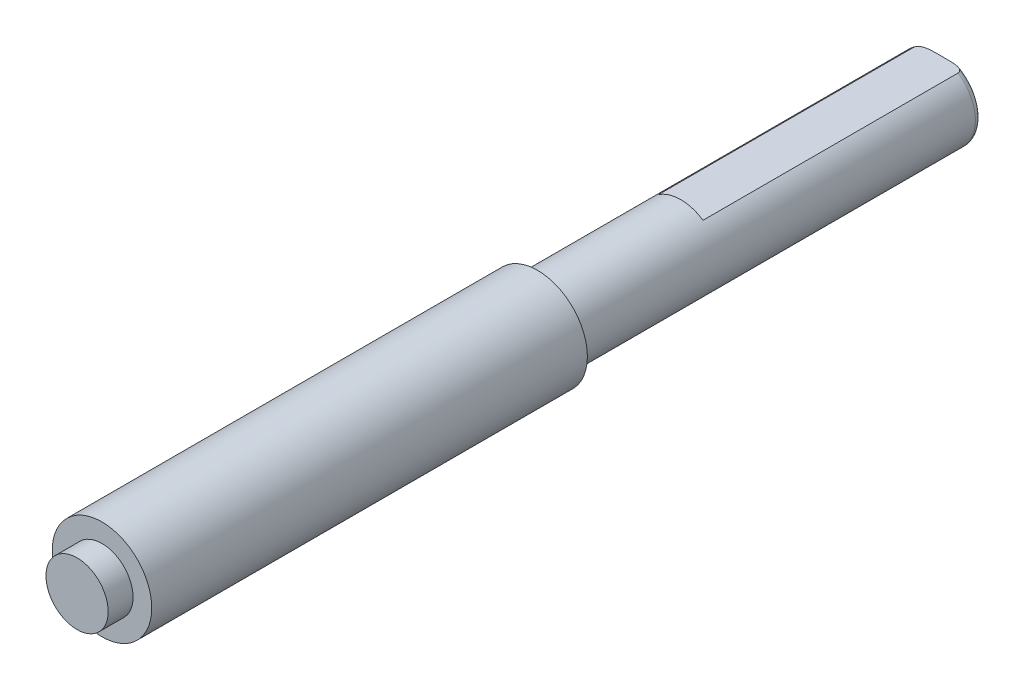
from build123d import *

# Parameters (mm, degrees)
SKETCH_2_R          = 3.175
EXTRUDE_1_DEPTH     = 32.5
SKETCH_3_R          = 4
EXTRUDE_2_DEPTH     = 35
CUT_EXTRUDE_1_DEPTH = 21
FILLET_1_R          = 0.5
SKETCH_5_R          = 2.5
EXTRUDE_3_DEPTH     = 2


with BuildPart() as part:
    # Sketch 2 → Extrude 1 (new body)
    with BuildSketch(Plane.XY):
        Circle(SKETCH_2_R)
    extrude(amount=EXTRUDE_1_DEPTH)

    # Sketch 3 → Extrude 2 (add)
    with BuildSketch(Plane.XY.offset(32.5)):
        Circle(SKETCH_3_R)
    extrude(amount=EXTRUDE_2_DEPTH)

    # Sketch 4 → Cut-Extrude 1 (cut)
    with BuildSketch(Plane(origin=(0, 0, 0), x_dir=(-1, 0, 0), z_dir=(0, 0, -1))):
        with BuildLine():
            Line((-1.78605711, 2.625), (1.78605711, 2.625))
            ThreePointArc((1.78605711, 2.625), (0, 3.175), (-1.78605711, 2.625))
        make_face()
    extrude(amount=-CUT_EXTRUDE_1_DEPTH, mode=Mode.SUBTRACT)

    # Fillet 1
    fillet_1_edges = [part.edges().sort_by_distance(p)[0] for p in [
        (-1.48490634, -2.806363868, 0),
    ]]
    fillet(fillet_1_edges, radius=FILLET_1_R)

    # Sketch 5 → Extrude 3 (add)
    with BuildSketch(Plane.XY.offset(67.5)):
        Circle(SKETCH_5_R)
    extrude(amount=EXTRUDE_3_DEPTH)


solid = part.part
